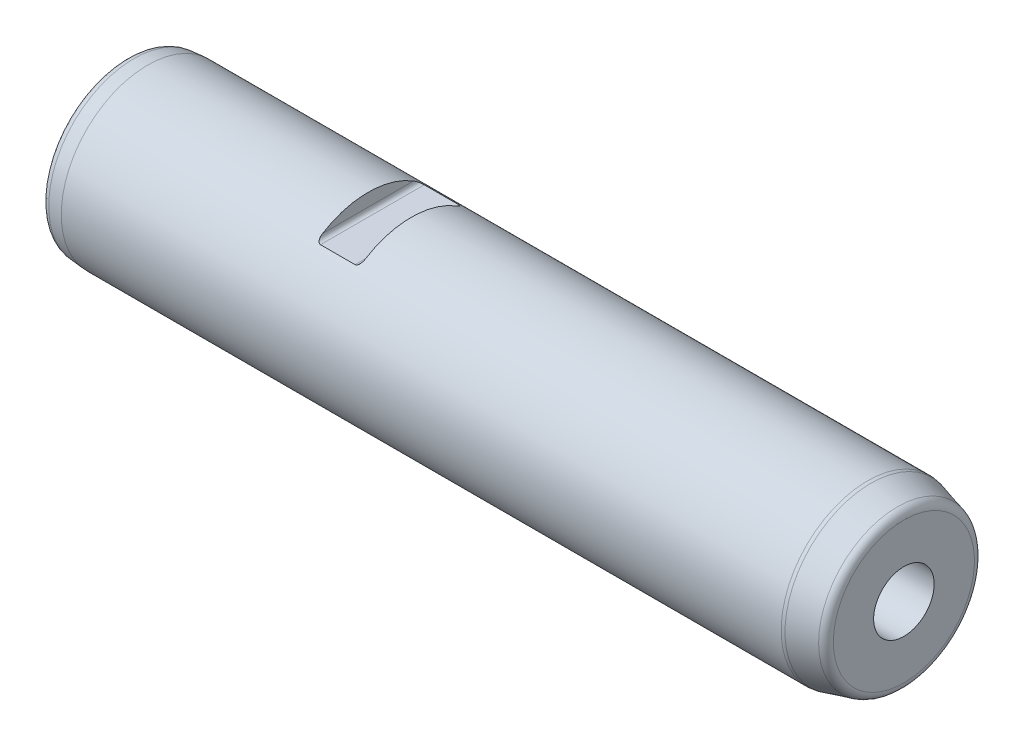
ISO-10303-21;
HEADER;
FILE_DESCRIPTION(('STEP AP214'),'2;1');
FILE_NAME('part.step','',(''),(''),'','','');
FILE_SCHEMA(('AUTOMOTIVE_DESIGN { 1 0 10303 214 1 1 1 1 }'));
ENDSEC;
DATA;
#1=APPLICATION_CONTEXT('core data for automotive mechanical design processes');
#2=APPLICATION_PROTOCOL_DEFINITION('international standard','automotive_design',2000,#1);
#3=PRODUCT_CONTEXT('',#1,'mechanical');
#4=PRODUCT('Part','Part','',(#3));
#5=PRODUCT_RELATED_PRODUCT_CATEGORY('part','',(#4));
#6=PRODUCT_DEFINITION_FORMATION('','',#4);
#7=PRODUCT_DEFINITION_CONTEXT('part definition',#1,'design');
#8=PRODUCT_DEFINITION('design','',#6,#7);
#9=PRODUCT_DEFINITION_SHAPE('','',#8);
#10=(LENGTH_UNIT() NAMED_UNIT(*) SI_UNIT(.MILLI.,.METRE.));
#11=(NAMED_UNIT(*) PLANE_ANGLE_UNIT() SI_UNIT($,.RADIAN.));
#12=(NAMED_UNIT(*) SI_UNIT($,.STERADIAN.) SOLID_ANGLE_UNIT());
#13=UNCERTAINTY_MEASURE_WITH_UNIT(LENGTH_MEASURE(1.E-05),#10,'distance_accuracy_value','');
#14=(GEOMETRIC_REPRESENTATION_CONTEXT(3) GLOBAL_UNCERTAINTY_ASSIGNED_CONTEXT((#13)) GLOBAL_UNIT_ASSIGNED_CONTEXT((#10,
#11,#12)) REPRESENTATION_CONTEXT('',''));
#15=CARTESIAN_POINT('',(0.,0.,0.));
#16=DIRECTION('',(0.,0.,1.));
#17=DIRECTION('',(1.,0.,0.));
#18=AXIS2_PLACEMENT_3D('',#15,#16,#17);
#19=CARTESIAN_POINT('',(0.,0.,0.));
#20=DIRECTION('',(1.,0.,0.));
#21=DIRECTION('',(0.,0.,-1.));
#22=AXIS2_PLACEMENT_3D('',#19,#20,#21);
#23=PLANE('',#22);
#24=CARTESIAN_POINT('',(0.,0.,0.));
#25=DIRECTION('',(1.,0.,0.));
#26=DIRECTION('',(0.,0.,-1.));
#27=AXIS2_PLACEMENT_3D('',#24,#25,#26);
#28=CIRCLE('',#27,17.7298943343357);
#29=CARTESIAN_POINT('',(0.,0.,-17.7298943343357));
#30=VERTEX_POINT('',#29);
#31=EDGE_CURVE('E160',#30,#30,#28,.F.);
#32=ORIENTED_EDGE('',*,*,#31,.T.);
#33=EDGE_LOOP('',(#32));
#34=FACE_BOUND('',#33,.T.);
#35=ADVANCED_FACE('F15',(#34),#23,.F.);
#36=CARTESIAN_POINT('',(0.,0.,0.));
#37=DIRECTION('',(-1.,0.,0.));
#38=DIRECTION('',(0.,0.,1.));
#39=AXIS2_PLACEMENT_3D('',#36,#37,#38);
#40=CYLINDRICAL_SURFACE('',#39,20.);
#41=CARTESIAN_POINT('',(65.,16.,-12.));
#42=CARTESIAN_POINT('',(65.0203975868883,15.9999962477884,-12.0000045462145));
#43=CARTESIAN_POINT('',(65.0407804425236,16.0006247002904,-11.9991670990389));
#44=CARTESIAN_POINT('',(65.0813146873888,16.0031055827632,-11.9958583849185));
#45=CARTESIAN_POINT('',(65.1014663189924,16.004956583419,-11.993389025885));
#46=CARTESIAN_POINT('',(65.1608545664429,16.0122253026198,-11.9836850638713));
#47=CARTESIAN_POINT('',(65.1995323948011,16.0193609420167,-11.9741518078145));
#48=CARTESIAN_POINT('',(65.2739645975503,16.037497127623,-11.9498497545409));
#49=CARTESIAN_POINT('',(65.3097307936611,16.0484809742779,-11.9351035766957));
#50=CARTESIAN_POINT('',(65.3781242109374,16.0735266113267,-11.9013522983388));
#51=CARTESIAN_POINT('',(65.41074138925,16.087597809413,-11.8823341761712));
#52=CARTESIAN_POINT('',(65.4887324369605,16.1259889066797,-11.8302152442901));
#53=CARTESIAN_POINT('',(65.5318948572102,16.1518280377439,-11.7949407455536));
#54=CARTESIAN_POINT('',(65.6109129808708,16.2068340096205,-11.7192462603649));
#55=CARTESIAN_POINT('',(65.6467545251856,16.2360071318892,-11.678816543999));
#56=CARTESIAN_POINT('',(65.7058021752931,16.2906763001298,-11.6023981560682));
#57=CARTESIAN_POINT('',(65.7301168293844,16.3158314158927,-11.567005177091));
#58=CARTESIAN_POINT('',(65.774915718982,16.3670212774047,-11.4944592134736));
#59=CARTESIAN_POINT('',(65.7953974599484,16.3930565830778,-11.4573051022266));
#60=CARTESIAN_POINT('',(65.8518244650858,16.4721604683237,-11.343563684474));
#61=CARTESIAN_POINT('',(65.8825725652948,16.5260510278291,-11.2649424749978));
#62=CARTESIAN_POINT('',(65.9240070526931,16.6156385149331,-11.1321438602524));
#63=CARTESIAN_POINT('',(65.9379569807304,16.6512330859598,-11.0788360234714));
#64=CARTESIAN_POINT('',(65.9614191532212,16.7223722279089,-10.9711632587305));
#65=CARTESIAN_POINT('',(65.9709289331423,16.7579167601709,-10.9167977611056));
#66=CARTESIAN_POINT('',(65.9857688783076,16.8281581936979,-10.808200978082));
#67=CARTESIAN_POINT('',(65.9911623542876,16.862859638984,-10.7539810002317));
#68=CARTESIAN_POINT('',(65.998268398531,16.9317984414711,-10.6451097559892));
#69=CARTESIAN_POINT('',(65.999986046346,16.9660363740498,-10.5904591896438));
#70=CARTESIAN_POINT('',(66.,17.,-10.5356537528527));
#71=B_SPLINE_CURVE_WITH_KNOTS('',3,(#41,#42,#43,#44,#45,#46,#47,#48,#49,#50,#51,#52,#53,#54,#55,
#56,#57,#58,#59,#60,#61,#62,#63,#64,#65,#66,#67,#68,#69,#70),.UNSPECIFIED.,.F.,.F.,(4,2,2,2,2,2,
2,2,2,2,2,2,2,2,4),(0.,0.0611385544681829,0.122205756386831,0.242843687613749,0.36296445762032,
0.483456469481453,0.666747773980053,0.850390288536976,0.999479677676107,1.14866576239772,
1.44807901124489,1.64475203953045,1.841534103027,2.03522492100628,2.22864790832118),.UNSPECIFIED.);
#72=CARTESIAN_POINT('',(65.,16.,-12.));
#73=VERTEX_POINT('',#72);
#74=CARTESIAN_POINT('',(66.,17.,-10.5356537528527));
#75=VERTEX_POINT('',#74);
#76=EDGE_CURVE('E206',#73,#75,#71,.T.);
#77=ORIENTED_EDGE('',*,*,#76,.T.);
#78=CARTESIAN_POINT('',(66.,0.,0.));
#79=DIRECTION('',(1.,0.,0.));
#80=DIRECTION('',(0.,0.,-1.));
#81=AXIS2_PLACEMENT_3D('',#78,#79,#80);
#82=CIRCLE('',#81,20.);
#83=CARTESIAN_POINT('',(66.,17.,10.5356537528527));
#84=VERTEX_POINT('',#83);
#85=EDGE_CURVE('E9',#75,#84,#82,.T.);
#86=ORIENTED_EDGE('',*,*,#85,.T.);
#87=CARTESIAN_POINT('',(66.,17.,10.5356537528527));
#88=CARTESIAN_POINT('',(65.9999580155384,16.9556282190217,10.6072606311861));
#89=CARTESIAN_POINT('',(65.9970414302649,16.9107662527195,10.6786284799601));
#90=CARTESIAN_POINT('',(65.9847801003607,16.8201915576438,10.8207316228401));
#91=CARTESIAN_POINT('',(65.9754049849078,16.7744758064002,10.8914623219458));
#92=CARTESIAN_POINT('',(65.9494193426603,16.6823378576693,11.0320779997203));
#93=CARTESIAN_POINT('',(65.9327445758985,16.6359130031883,11.1019496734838));
#94=CARTESIAN_POINT('',(65.8911331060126,16.5434346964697,11.2392876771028));
#95=CARTESIAN_POINT('',(65.8662148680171,16.4973806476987,11.3067590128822));
#96=CARTESIAN_POINT('',(65.8154112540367,16.4198497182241,11.4189199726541));
#97=CARTESIAN_POINT('',(65.7919526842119,16.3880587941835,11.4644877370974));
#98=CARTESIAN_POINT('',(65.739534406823,16.3256491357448,11.5531862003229));
#99=CARTESIAN_POINT('',(65.7105793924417,16.2950294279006,11.596318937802));
#100=CARTESIAN_POINT('',(65.6461040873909,16.2354774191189,11.6795510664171));
#101=CARTESIAN_POINT('',(65.610528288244,16.2065623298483,11.719620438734));
#102=CARTESIAN_POINT('',(65.5321445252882,16.1520057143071,11.7946959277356));
#103=CARTESIAN_POINT('',(65.489347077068,16.1263595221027,11.829709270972));
#104=CARTESIAN_POINT('',(65.4114116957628,16.0878834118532,11.8819483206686));
#105=CARTESIAN_POINT('',(65.3783803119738,16.0736117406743,11.9012377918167));
#106=CARTESIAN_POINT('',(65.3090792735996,16.048251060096,11.9354131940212));
#107=CARTESIAN_POINT('',(65.2728207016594,16.0371516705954,11.9503134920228));
#108=CARTESIAN_POINT('',(65.1981046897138,16.0190813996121,11.9745255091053));
#109=CARTESIAN_POINT('',(65.1596911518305,16.0120479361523,11.9839219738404));
#110=CARTESIAN_POINT('',(65.10072428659,16.0048841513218,11.9934856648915));
#111=CARTESIAN_POINT('',(65.0807179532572,16.0030600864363,11.9959190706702));
#112=CARTESIAN_POINT('',(65.040479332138,16.0006154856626,11.9991793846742));
#113=CARTESIAN_POINT('',(65.0202468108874,15.9999963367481,12.0000044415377));
#114=CARTESIAN_POINT('',(65.,16.,12.));
#115=B_SPLINE_CURVE_WITH_KNOTS('',3,(#87,#88,#89,#90,#91,#92,#93,#94,#95,#96,#97,#98,#99,#100,
#101,#102,#103,#104,#105,#106,#107,#108,#109,#110,#111,#112,#113,#114),.UNSPECIFIED.,.F.,.F.,(4,
2,2,2,2,2,2,2,2,2,2,2,2,4),(0.,0.252754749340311,0.506706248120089,0.762939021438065,
1.01860168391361,1.19928577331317,1.37981627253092,1.56193473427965,1.74379026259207,
1.86586776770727,1.98754112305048,2.10728809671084,2.16790599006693,2.22859361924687),.UNSPECIFIED.);
#116=CARTESIAN_POINT('',(65.,16.,12.));
#117=VERTEX_POINT('',#116);
#118=EDGE_CURVE('E23',#84,#117,#115,.T.);
#119=ORIENTED_EDGE('',*,*,#118,.T.);
#120=DIRECTION('',(-1.,0.,0.));
#121=VECTOR('',#120,1.);
#122=CARTESIAN_POINT('',(0.,16.,12.));
#123=LINE('',#122,#121);
#124=CARTESIAN_POINT('',(57.,16.,12.));
#125=VERTEX_POINT('',#124);
#126=EDGE_CURVE('E74',#117,#125,#123,.T.);
#127=ORIENTED_EDGE('',*,*,#126,.T.);
#128=CARTESIAN_POINT('',(57.,16.,12.));
#129=CARTESIAN_POINT('',(56.9796024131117,15.9999962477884,12.0000045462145));
#130=CARTESIAN_POINT('',(56.9592195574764,16.0006247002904,11.9991670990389));
#131=CARTESIAN_POINT('',(56.9186853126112,16.0031055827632,11.9958583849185));
#132=CARTESIAN_POINT('',(56.8985336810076,16.004956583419,11.993389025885));
#133=CARTESIAN_POINT('',(56.839145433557,16.0122253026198,11.9836850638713));
#134=CARTESIAN_POINT('',(56.8004676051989,16.0193609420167,11.9741518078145));
#135=CARTESIAN_POINT('',(56.7260354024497,16.037497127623,11.9498497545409));
#136=CARTESIAN_POINT('',(56.6902692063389,16.0484809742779,11.9351035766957));
#137=CARTESIAN_POINT('',(56.6218757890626,16.0735266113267,11.9013522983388));
#138=CARTESIAN_POINT('',(56.58925861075,16.087597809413,11.8823341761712));
#139=CARTESIAN_POINT('',(56.5112675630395,16.1259889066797,11.8302152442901));
#140=CARTESIAN_POINT('',(56.4681051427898,16.1518280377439,11.7949407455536));
#141=CARTESIAN_POINT('',(56.3890870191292,16.2068340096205,11.7192462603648));
#142=CARTESIAN_POINT('',(56.3532454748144,16.2360071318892,11.678816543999));
#143=CARTESIAN_POINT('',(56.2941978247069,16.2906763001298,11.6023981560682));
#144=CARTESIAN_POINT('',(56.2698831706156,16.3158314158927,11.567005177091));
#145=CARTESIAN_POINT('',(56.225084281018,16.3670212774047,11.4944592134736));
#146=CARTESIAN_POINT('',(56.2046025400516,16.3930565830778,11.4573051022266));
#147=CARTESIAN_POINT('',(56.1481755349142,16.4721604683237,11.343563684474));
#148=CARTESIAN_POINT('',(56.1174274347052,16.5260510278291,11.2649424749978));
#149=CARTESIAN_POINT('',(56.0759929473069,16.6156385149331,11.1321438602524));
#150=CARTESIAN_POINT('',(56.0620430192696,16.6512330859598,11.0788360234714));
#151=CARTESIAN_POINT('',(56.0385808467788,16.7223722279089,10.9711632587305));
#152=CARTESIAN_POINT('',(56.0290710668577,16.7579167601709,10.9167977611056));
#153=CARTESIAN_POINT('',(56.0142311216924,16.8281581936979,10.808200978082));
#154=CARTESIAN_POINT('',(56.0088376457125,16.862859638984,10.7539810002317));
#155=CARTESIAN_POINT('',(56.001731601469,16.9317984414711,10.6451097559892));
#156=CARTESIAN_POINT('',(56.000013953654,16.9660363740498,10.5904591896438));
#157=CARTESIAN_POINT('',(56.,17.,10.5356537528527));
#158=B_SPLINE_CURVE_WITH_KNOTS('',3,(#128,#129,#130,#131,#132,#133,#134,#135,#136,#137,#138,
#139,#140,#141,#142,#143,#144,#145,#146,#147,#148,#149,#150,#151,#152,#153,#154,#155,#156,#157),
.UNSPECIFIED.,.F.,.F.,(4,2,2,2,2,2,2,2,2,2,2,2,2,2,4),(0.,0.061138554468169,0.122205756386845,
0.242843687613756,0.362964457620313,0.483456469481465,0.666747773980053,0.850390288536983,
0.999479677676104,1.14866576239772,1.4480790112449,1.64475203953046,1.841534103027,
2.03522492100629,2.22864790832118),.UNSPECIFIED.);
#159=CARTESIAN_POINT('',(56.,17.,10.5356537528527));
#160=VERTEX_POINT('',#159);
#161=EDGE_CURVE('E65',#125,#160,#158,.T.);
#162=ORIENTED_EDGE('',*,*,#161,.T.);
#163=CARTESIAN_POINT('',(56.,0.,0.));
#164=DIRECTION('',(-1.,0.,0.));
#165=DIRECTION('',(0.,0.,1.));
#166=AXIS2_PLACEMENT_3D('',#163,#164,#165);
#167=CIRCLE('',#166,20.);
#168=CARTESIAN_POINT('',(56.,17.,-10.5356537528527));
#169=VERTEX_POINT('',#168);
#170=EDGE_CURVE('E54',#160,#169,#167,.T.);
#171=ORIENTED_EDGE('',*,*,#170,.T.);
#172=CARTESIAN_POINT('',(56.,17.,-10.5356537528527));
#173=CARTESIAN_POINT('',(56.0000419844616,16.9556282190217,-10.6072606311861));
#174=CARTESIAN_POINT('',(56.0029585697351,16.9107662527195,-10.6786284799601));
#175=CARTESIAN_POINT('',(56.0152198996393,16.8201915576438,-10.8207316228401));
#176=CARTESIAN_POINT('',(56.0245950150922,16.7744758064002,-10.8914623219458));
#177=CARTESIAN_POINT('',(56.0505806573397,16.6823378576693,-11.0320779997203));
#178=CARTESIAN_POINT('',(56.0672554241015,16.6359130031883,-11.1019496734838));
#179=CARTESIAN_POINT('',(56.1088668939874,16.5434346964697,-11.2392876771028));
#180=CARTESIAN_POINT('',(56.1337851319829,16.4973806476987,-11.3067590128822));
#181=CARTESIAN_POINT('',(56.1845887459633,16.4198497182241,-11.4189199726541));
#182=CARTESIAN_POINT('',(56.2080473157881,16.3880587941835,-11.4644877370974));
#183=CARTESIAN_POINT('',(56.260465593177,16.3256491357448,-11.5531862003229));
#184=CARTESIAN_POINT('',(56.2894206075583,16.2950294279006,-11.596318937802));
#185=CARTESIAN_POINT('',(56.3538959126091,16.2354774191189,-11.6795510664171));
#186=CARTESIAN_POINT('',(56.389471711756,16.2065623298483,-11.719620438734));
#187=CARTESIAN_POINT('',(56.4678554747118,16.1520057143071,-11.7946959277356));
#188=CARTESIAN_POINT('',(56.510652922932,16.1263595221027,-11.829709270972));
#189=CARTESIAN_POINT('',(56.5885883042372,16.0878834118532,-11.8819483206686));
#190=CARTESIAN_POINT('',(56.6216196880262,16.0736117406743,-11.9012377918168));
#191=CARTESIAN_POINT('',(56.6909207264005,16.0482510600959,-11.9354131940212));
#192=CARTESIAN_POINT('',(56.7271792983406,16.0371516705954,-11.9503134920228));
#193=CARTESIAN_POINT('',(56.8018953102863,16.0190813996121,-11.9745255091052));
#194=CARTESIAN_POINT('',(56.8403088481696,16.0120479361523,-11.9839219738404));
#195=CARTESIAN_POINT('',(56.89927571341,16.0048841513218,-11.9934856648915));
#196=CARTESIAN_POINT('',(56.9192820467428,16.0030600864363,-11.9959190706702));
#197=CARTESIAN_POINT('',(56.959520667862,16.0006154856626,-11.9991793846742));
#198=CARTESIAN_POINT('',(56.9797531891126,15.9999963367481,-12.0000044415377));
#199=CARTESIAN_POINT('',(57.,16.,-12.));
#200=B_SPLINE_CURVE_WITH_KNOTS('',3,(#172,#173,#174,#175,#176,#177,#178,#179,#180,#181,#182,
#183,#184,#185,#186,#187,#188,#189,#190,#191,#192,#193,#194,#195,#196,#197,#198,#199),
.UNSPECIFIED.,.F.,.F.,(4,2,2,2,2,2,2,2,2,2,2,2,2,4),(0.,0.252754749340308,0.506706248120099,
0.762939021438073,1.0186016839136,1.19928577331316,1.37981627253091,1.56193473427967,
1.74379026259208,1.86586776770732,1.98754112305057,2.10728809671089,2.16790599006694,
2.22859361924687),.UNSPECIFIED.);
#201=CARTESIAN_POINT('',(57.,16.,-12.));
#202=VERTEX_POINT('',#201);
#203=EDGE_CURVE('E59',#169,#202,#200,.T.);
#204=ORIENTED_EDGE('',*,*,#203,.T.);
#205=DIRECTION('',(-1.,0.,0.));
#206=VECTOR('',#205,1.);
#207=CARTESIAN_POINT('',(0.,16.,-12.));
#208=LINE('',#207,#206);
#209=EDGE_CURVE('E75',#202,#73,#208,.F.);
#210=ORIENTED_EDGE('',*,*,#209,.T.);
#211=EDGE_LOOP('',(#77,#86,#119,#127,#162,#171,#204,#210));
#212=FACE_BOUND('',#211,.T.);
#213=CARTESIAN_POINT('',(4.99999999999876,0.,0.));
#214=DIRECTION('',(1.,0.,0.));
#215=DIRECTION('',(0.,0.,-1.));
#216=AXIS2_PLACEMENT_3D('',#213,#214,#215);
#217=CIRCLE('',#216,20.);
#218=CARTESIAN_POINT('',(4.99999999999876,0.,-20.));
#219=VERTEX_POINT('',#218);
#220=EDGE_CURVE('E159',#219,#219,#217,.T.);
#221=ORIENTED_EDGE('',*,*,#220,.T.);
#222=EDGE_LOOP('',(#221));
#223=FACE_BOUND('',#222,.T.);
#224=CARTESIAN_POINT('',(171.605042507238,0.,0.));
#225=DIRECTION('',(1.,0.,0.));
#226=DIRECTION('',(0.,0.,-1.));
#227=AXIS2_PLACEMENT_3D('',#224,#225,#226);
#228=CIRCLE('',#227,20.);
#229=CARTESIAN_POINT('',(171.605042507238,0.,-20.));
#230=VERTEX_POINT('',#229);
#231=EDGE_CURVE('E177',#230,#230,#228,.F.);
#232=ORIENTED_EDGE('',*,*,#231,.T.);
#233=EDGE_LOOP('',(#232));
#234=FACE_BOUND('',#233,.T.);
#235=ADVANCED_FACE('F71',(#212,#223,#234),#40,.T.);
#236=CARTESIAN_POINT('',(180.,0.,0.));
#237=DIRECTION('',(-1.,0.,0.));
#238=DIRECTION('',(0.,0.,1.));
#239=AXIS2_PLACEMENT_3D('',#236,#237,#238);
#240=CONICAL_SURFACE('',#239,17.856406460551,0.26179938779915);
#241=CARTESIAN_POINT('',(178.517638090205,0.,0.));
#242=DIRECTION('',(1.,0.,0.));
#243=DIRECTION('',(0.,0.,-1.));
#244=AXIS2_PLACEMENT_3D('',#241,#242,#243);
#245=CIRCLE('',#244,18.2536041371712);
#246=CARTESIAN_POINT('',(178.517638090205,0.,-18.2536041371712));
#247=VERTEX_POINT('',#246);
#248=EDGE_CURVE('E165',#247,#247,#245,.F.);
#249=ORIENTED_EDGE('',*,*,#248,.T.);
#250=EDGE_LOOP('',(#249));
#251=FACE_BOUND('',#250,.T.);
#252=CARTESIAN_POINT('',(172.381499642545,0.,0.));
#253=DIRECTION('',(1.,0.,0.));
#254=DIRECTION('',(0.,0.,-1.));
#255=AXIS2_PLACEMENT_3D('',#252,#253,#254);
#256=CIRCLE('',#255,19.8977774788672);
#257=CARTESIAN_POINT('',(172.381499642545,0.,-19.8977774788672));
#258=VERTEX_POINT('',#257);
#259=EDGE_CURVE('E190',#258,#258,#256,.T.);
#260=ORIENTED_EDGE('',*,*,#259,.T.);
#261=EDGE_LOOP('',(#260));
#262=FACE_BOUND('',#261,.T.);
#263=ADVANCED_FACE('F122',(#251,#262),#240,.T.);
#264=CARTESIAN_POINT('',(180.,17.856406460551,0.));
#265=DIRECTION('',(-1.,0.,0.));
#266=DIRECTION('',(0.,0.,1.));
#267=AXIS2_PLACEMENT_3D('',#264,#265,#266);
#268=PLANE('',#267);
#269=CARTESIAN_POINT('',(180.,0.,0.));
#270=DIRECTION('',(1.,0.,0.));
#271=DIRECTION('',(0.,0.,-1.));
#272=AXIS2_PLACEMENT_3D('',#269,#270,#271);
#273=CIRCLE('',#272,7.);
#274=CARTESIAN_POINT('',(180.,0.,-7.));
#275=VERTEX_POINT('',#274);
#276=EDGE_CURVE('E180',#275,#275,#273,.T.);
#277=ORIENTED_EDGE('',*,*,#276,.F.);
#278=EDGE_LOOP('',(#277));
#279=FACE_BOUND('',#278,.T.);
#280=CARTESIAN_POINT('',(180.,0.,0.));
#281=DIRECTION('',(-1.,0.,0.));
#282=DIRECTION('',(0.,0.,1.));
#283=AXIS2_PLACEMENT_3D('',#280,#281,#282);
#284=CIRCLE('',#283,16.3217524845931);
#285=CARTESIAN_POINT('',(180.,0.,16.3217524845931));
#286=VERTEX_POINT('',#285);
#287=EDGE_CURVE('E161',#286,#286,#284,.F.);
#288=ORIENTED_EDGE('',*,*,#287,.T.);
#289=EDGE_LOOP('',(#288));
#290=FACE_BOUND('',#289,.T.);
#291=ADVANCED_FACE('F119',(#279,#290),#268,.F.);
#292=CARTESIAN_POINT('',(171.605042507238,0.,0.));
#293=DIRECTION('',(1.,0.,0.));
#294=DIRECTION('',(0.,0.,-1.));
#295=AXIS2_PLACEMENT_3D('',#292,#293,#294);
#296=TOROIDAL_SURFACE('',#295,17.,3.);
#297=ORIENTED_EDGE('',*,*,#259,.F.);
#298=EDGE_LOOP('',(#297));
#299=FACE_BOUND('',#298,.T.);
#300=ORIENTED_EDGE('',*,*,#231,.F.);
#301=EDGE_LOOP('',(#300));
#302=FACE_BOUND('',#301,.T.);
#303=ADVANCED_FACE('F121',(#299,#302),#296,.T.);
#304=CARTESIAN_POINT('',(178.,0.,0.));
#305=DIRECTION('',(-1.,0.,0.));
#306=DIRECTION('',(0.,0.,1.));
#307=AXIS2_PLACEMENT_3D('',#304,#305,#306);
#308=TOROIDAL_SURFACE('',#307,16.3217524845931,2.);
#309=ORIENTED_EDGE('',*,*,#287,.F.);
#310=EDGE_LOOP('',(#309));
#311=FACE_BOUND('',#310,.T.);
#312=ORIENTED_EDGE('',*,*,#248,.F.);
#313=EDGE_LOOP('',(#312));
#314=FACE_BOUND('',#313,.T.);
#315=ADVANCED_FACE('F142',(#311,#314),#308,.T.);
#316=CARTESIAN_POINT('',(0.,0.,0.));
#317=DIRECTION('',(1.,0.,0.));
#318=DIRECTION('',(0.,0.,-1.));
#319=AXIS2_PLACEMENT_3D('',#316,#317,#318);
#320=CONICAL_SURFACE('',#319,19.5625566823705,0.0872664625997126);
#321=CARTESIAN_POINT('',(1.82568851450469,0.,0.));
#322=DIRECTION('',(1.,0.,0.));
#323=DIRECTION('',(0.,0.,-1.));
#324=AXIS2_PLACEMENT_3D('',#321,#322,#323);
#325=CIRCLE('',#324,19.7222837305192);
#326=CARTESIAN_POINT('',(1.82568851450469,0.,-19.7222837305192));
#327=VERTEX_POINT('',#326);
#328=EDGE_CURVE('E60',#327,#327,#325,.T.);
#329=ORIENTED_EDGE('',*,*,#328,.T.);
#330=EDGE_LOOP('',(#329));
#331=FACE_BOUND('',#330,.T.);
#332=ORIENTED_EDGE('',*,*,#220,.F.);
#333=EDGE_LOOP('',(#332));
#334=FACE_BOUND('',#333,.T.);
#335=ADVANCED_FACE('F145',(#331,#334),#320,.T.);
#336=CARTESIAN_POINT('',(2.,0.,0.));
#337=DIRECTION('',(1.,0.,0.));
#338=DIRECTION('',(0.,0.,-1.));
#339=AXIS2_PLACEMENT_3D('',#336,#337,#338);
#340=TOROIDAL_SURFACE('',#339,17.7298943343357,2.);
#341=ORIENTED_EDGE('',*,*,#328,.F.);
#342=EDGE_LOOP('',(#341));
#343=FACE_BOUND('',#342,.T.);
#344=ORIENTED_EDGE('',*,*,#31,.F.);
#345=EDGE_LOOP('',(#344));
#346=FACE_BOUND('',#345,.T.);
#347=ADVANCED_FACE('F17',(#343,#346),#340,.T.);
#348=CARTESIAN_POINT('',(156.,0.,0.));
#349=DIRECTION('',(1.,0.,0.));
#350=DIRECTION('',(0.,0.,-1.));
#351=AXIS2_PLACEMENT_3D('',#348,#349,#350);
#352=PLANE('',#351);
#353=CARTESIAN_POINT('',(156.,0.,0.));
#354=DIRECTION('',(1.,0.,0.));
#355=DIRECTION('',(0.,0.,-1.));
#356=AXIS2_PLACEMENT_3D('',#353,#354,#355);
#357=CIRCLE('',#356,7.);
#358=CARTESIAN_POINT('',(156.,0.,-7.));
#359=VERTEX_POINT('',#358);
#360=EDGE_CURVE('E173',#359,#359,#357,.T.);
#361=ORIENTED_EDGE('',*,*,#360,.T.);
#362=EDGE_LOOP('',(#361));
#363=FACE_BOUND('',#362,.T.);
#364=CARTESIAN_POINT('',(156.,0.,0.));
#365=DIRECTION('',(1.,0.,0.));
#366=DIRECTION('',(0.,0.,-1.));
#367=AXIS2_PLACEMENT_3D('',#364,#365,#366);
#368=CIRCLE('',#367,5.1);
#369=CARTESIAN_POINT('',(156.,0.,-5.1));
#370=VERTEX_POINT('',#369);
#371=EDGE_CURVE('E170',#370,#370,#368,.F.);
#372=ORIENTED_EDGE('',*,*,#371,.T.);
#373=EDGE_LOOP('',(#372));
#374=FACE_BOUND('',#373,.T.);
#375=ADVANCED_FACE('F103',(#363,#374),#352,.T.);
#376=CARTESIAN_POINT('',(156.,0.,0.));
#377=DIRECTION('',(1.,0.,0.));
#378=DIRECTION('',(0.,0.,-1.));
#379=AXIS2_PLACEMENT_3D('',#376,#377,#378);
#380=CYLINDRICAL_SURFACE('',#379,7.);
#381=ORIENTED_EDGE('',*,*,#360,.F.);
#382=EDGE_LOOP('',(#381));
#383=FACE_BOUND('',#382,.T.);
#384=ORIENTED_EDGE('',*,*,#276,.T.);
#385=EDGE_LOOP('',(#384));
#386=FACE_BOUND('',#385,.T.);
#387=ADVANCED_FACE('F106',(#383,#386),#380,.F.);
#388=CARTESIAN_POINT('',(150.,0.,0.));
#389=DIRECTION('',(1.,0.,0.));
#390=DIRECTION('',(0.,0.,-1.));
#391=AXIS2_PLACEMENT_3D('',#388,#389,#390);
#392=CONICAL_SURFACE('',#391,5.1,1.0471975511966);
#393=CARTESIAN_POINT('',(147.055513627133,0.,0.));
#394=VERTEX_POINT('',#393);
#395=VERTEX_LOOP('',#394);
#396=FACE_BOUND('',#395,.T.);
#397=CARTESIAN_POINT('',(150.,0.,0.));
#398=DIRECTION('',(1.,0.,0.));
#399=DIRECTION('',(0.,0.,-1.));
#400=AXIS2_PLACEMENT_3D('',#397,#398,#399);
#401=CIRCLE('',#400,5.1);
#402=CARTESIAN_POINT('',(150.,0.,-5.1));
#403=VERTEX_POINT('',#402);
#404=EDGE_CURVE('E172',#403,#403,#401,.T.);
#405=ORIENTED_EDGE('',*,*,#404,.T.);
#406=EDGE_LOOP('',(#405));
#407=FACE_BOUND('',#406,.T.);
#408=ADVANCED_FACE('F110',(#396,#407),#392,.F.);
#409=CARTESIAN_POINT('',(180.,0.,0.));
#410=DIRECTION('',(1.,0.,0.));
#411=DIRECTION('',(0.,0.,-1.));
#412=AXIS2_PLACEMENT_3D('',#409,#410,#411);
#413=CYLINDRICAL_SURFACE('',#412,5.1);
#414=ORIENTED_EDGE('',*,*,#404,.F.);
#415=EDGE_LOOP('',(#414));
#416=FACE_BOUND('',#415,.T.);
#417=ORIENTED_EDGE('',*,*,#371,.F.);
#418=EDGE_LOOP('',(#417));
#419=FACE_BOUND('',#418,.T.);
#420=ADVANCED_FACE('F112',(#416,#419),#413,.F.);
#421=CARTESIAN_POINT('',(66.,17.,-20.));
#422=DIRECTION('',(1.,0.,0.));
#423=DIRECTION('',(0.,0.,-1.));
#424=AXIS2_PLACEMENT_3D('',#421,#422,#423);
#425=PLANE('',#424);
#426=DIRECTION('',(0.,0.,1.));
#427=VECTOR('',#426,1.);
#428=CARTESIAN_POINT('',(66.,17.,-20.));
#429=LINE('',#428,#427);
#430=EDGE_CURVE('E184',#75,#84,#429,.T.);
#431=ORIENTED_EDGE('',*,*,#430,.T.);
#432=ORIENTED_EDGE('',*,*,#85,.F.);
#433=EDGE_LOOP('',(#431,#432));
#434=FACE_BOUND('',#433,.T.);
#435=ADVANCED_FACE('F115',(#434),#425,.F.);
#436=CARTESIAN_POINT('',(65.,17.,-20.));
#437=DIRECTION('',(0.,0.,1.));
#438=DIRECTION('',(1.,0.,0.));
#439=AXIS2_PLACEMENT_3D('',#436,#437,#438);
#440=CYLINDRICAL_SURFACE('',#439,1.);
#441=ORIENTED_EDGE('',*,*,#430,.F.);
#442=ORIENTED_EDGE('',*,*,#76,.F.);
#443=DIRECTION('',(0.,0.,1.));
#444=VECTOR('',#443,1.);
#445=CARTESIAN_POINT('',(65.,16.,-20.));
#446=LINE('',#445,#444);
#447=EDGE_CURVE('E199',#73,#117,#446,.T.);
#448=ORIENTED_EDGE('',*,*,#447,.T.);
#449=ORIENTED_EDGE('',*,*,#118,.F.);
#450=EDGE_LOOP('',(#441,#442,#448,#449));
#451=FACE_BOUND('',#450,.T.);
#452=ADVANCED_FACE('F217',(#451),#440,.F.);
#453=CARTESIAN_POINT('',(57.,16.,-20.));
#454=DIRECTION('',(0.,-1.,0.));
#455=DIRECTION('',(0.,0.,-1.));
#456=AXIS2_PLACEMENT_3D('',#453,#454,#455);
#457=PLANE('',#456);
#458=ORIENTED_EDGE('',*,*,#447,.F.);
#459=ORIENTED_EDGE('',*,*,#209,.F.);
#460=DIRECTION('',(0.,0.,1.));
#461=VECTOR('',#460,1.);
#462=CARTESIAN_POINT('',(57.,16.,-20.));
#463=LINE('',#462,#461);
#464=EDGE_CURVE('E67',#202,#125,#463,.T.);
#465=ORIENTED_EDGE('',*,*,#464,.T.);
#466=ORIENTED_EDGE('',*,*,#126,.F.);
#467=EDGE_LOOP('',(#458,#459,#465,#466));
#468=FACE_BOUND('',#467,.T.);
#469=ADVANCED_FACE('F98',(#468),#457,.F.);
#470=CARTESIAN_POINT('',(57.,17.,-20.));
#471=DIRECTION('',(0.,0.,1.));
#472=DIRECTION('',(1.,0.,0.));
#473=AXIS2_PLACEMENT_3D('',#470,#471,#472);
#474=CYLINDRICAL_SURFACE('',#473,1.);
#475=ORIENTED_EDGE('',*,*,#464,.F.);
#476=ORIENTED_EDGE('',*,*,#203,.F.);
#477=DIRECTION('',(0.,0.,1.));
#478=VECTOR('',#477,1.);
#479=CARTESIAN_POINT('',(56.,17.,-20.));
#480=LINE('',#479,#478);
#481=EDGE_CURVE('E29',#169,#160,#480,.T.);
#482=ORIENTED_EDGE('',*,*,#481,.T.);
#483=ORIENTED_EDGE('',*,*,#161,.F.);
#484=EDGE_LOOP('',(#475,#476,#482,#483));
#485=FACE_BOUND('',#484,.T.);
#486=ADVANCED_FACE('F64',(#485),#474,.F.);
#487=CARTESIAN_POINT('',(56.,20.,-20.));
#488=DIRECTION('',(-1.,0.,0.));
#489=DIRECTION('',(0.,0.,1.));
#490=AXIS2_PLACEMENT_3D('',#487,#488,#489);
#491=PLANE('',#490);
#492=ORIENTED_EDGE('',*,*,#481,.F.);
#493=ORIENTED_EDGE('',*,*,#170,.F.);
#494=EDGE_LOOP('',(#492,#493));
#495=FACE_BOUND('',#494,.T.);
#496=ADVANCED_FACE('F55',(#495),#491,.F.);
#497=CLOSED_SHELL('',(#35,#235,#263,#291,#303,#315,#335,#347,#375,#387,#408,#420,#435,#452,#469,
#486,#496));
#498=MANIFOLD_SOLID_BREP('B1',#497);
#499=ADVANCED_BREP_SHAPE_REPRESENTATION('',(#18,#498),#14);
#500=SHAPE_DEFINITION_REPRESENTATION(#9,#499);
ENDSEC;
END-ISO-10303-21;
